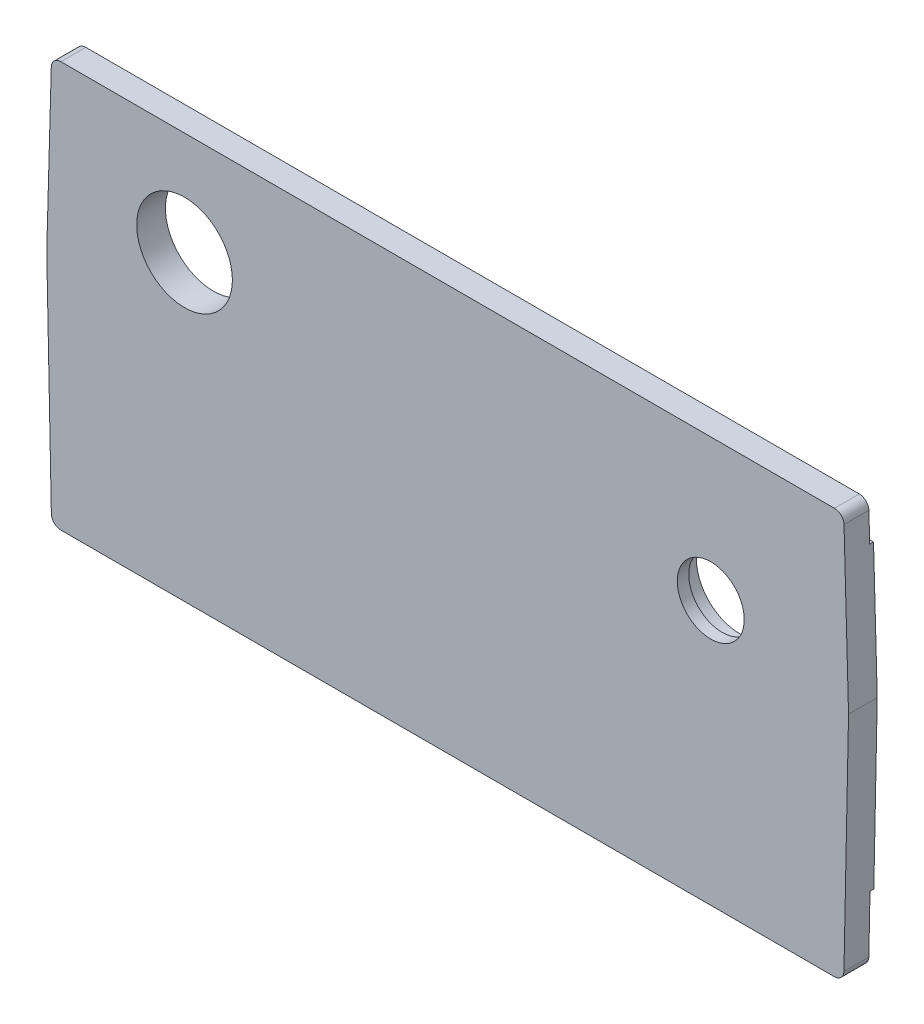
from build123d import *

# Parameters (mm, degrees)
ESQUISSE1_R             = 5
ESQUISSE1_R_2           = 3.5
BOSS_EXTRU_1_DEPTH      = 3
ESQUISSE2_R             = 4.5
ENL_V_MAT_EXTRU_1_DEPTH = 1.8
ESQUISSE3_W             = 86.164671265
ESQUISSE3_H             = 4
ESQUISSE3_H_2           = 7
ENL_V_MAT_EXTRU_2_DEPTH = 0.4


with BuildPart() as part:
    # Esquisse1 → Boss.-Extru.1 (new body)
    with BuildSketch(Plane.XY):
        with BuildLine():
            Line((1.479800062, 0), (82.320199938, 0))
            ThreePointArc((82.320199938, 0), (83.020055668, 0.285715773), (83.319991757, 0.979596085))
            Line((83.319991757, 0.979596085), (83.8, 24.5))
            Line((83.8, 24.5), (83.327153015, 41.42792207))
            ThreePointArc((83.327153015, 41.42792207), (83.02470786, 42.116910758), (82.327542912, 42.4))
            Line((82.327542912, 42.4), (1.472457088, 42.4))
            ThreePointArc((1.472457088, 42.4), (0.77529214, 42.116910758), (0.472846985, 41.42792207))
            Line((0.472846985, 41.42792207), (0, 24.5))
            Line((0, 24.5), (0.480008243, 0.979596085))
            ThreePointArc((0.480008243, 0.979596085), (0.779944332, 0.285715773), (1.479800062, 0))
        make_face()
        with Locations((14.4, 31.6)):
            Circle(ESQUISSE1_R, mode=Mode.SUBTRACT)
        with Locations((69.4, 27.6)):
            Circle(ESQUISSE1_R_2, mode=Mode.SUBTRACT)
    extrude(amount=BOSS_EXTRU_1_DEPTH)

    # Esquisse2 → Enl_v. mat.-Extru.1 (cut)
    with BuildSketch(Plane(origin=(0, 0, 0), x_dir=(-1, 0, 0), z_dir=(0, 0, -1))):
        with Locations((-69.4, 27.6)):
            Circle(ESQUISSE2_R)
    extrude(amount=-ENL_V_MAT_EXTRU_1_DEPTH, mode=Mode.SUBTRACT)

    # Esquisse3 → Enl_v. mat.-Extru.2 (cut)
    with BuildSketch(Plane(origin=(0, 0, 0), x_dir=(-1, 0, 0), z_dir=(0, 0, -1))):
        with Locations((-42.117528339, 40.4)):
            Rectangle(ESQUISSE3_W, ESQUISSE3_H)
        with Locations((-42.117528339, 3.5)):
            Rectangle(ESQUISSE3_W, ESQUISSE3_H_2)
    extrude(amount=-ENL_V_MAT_EXTRU_2_DEPTH, mode=Mode.SUBTRACT)


solid = part.part
